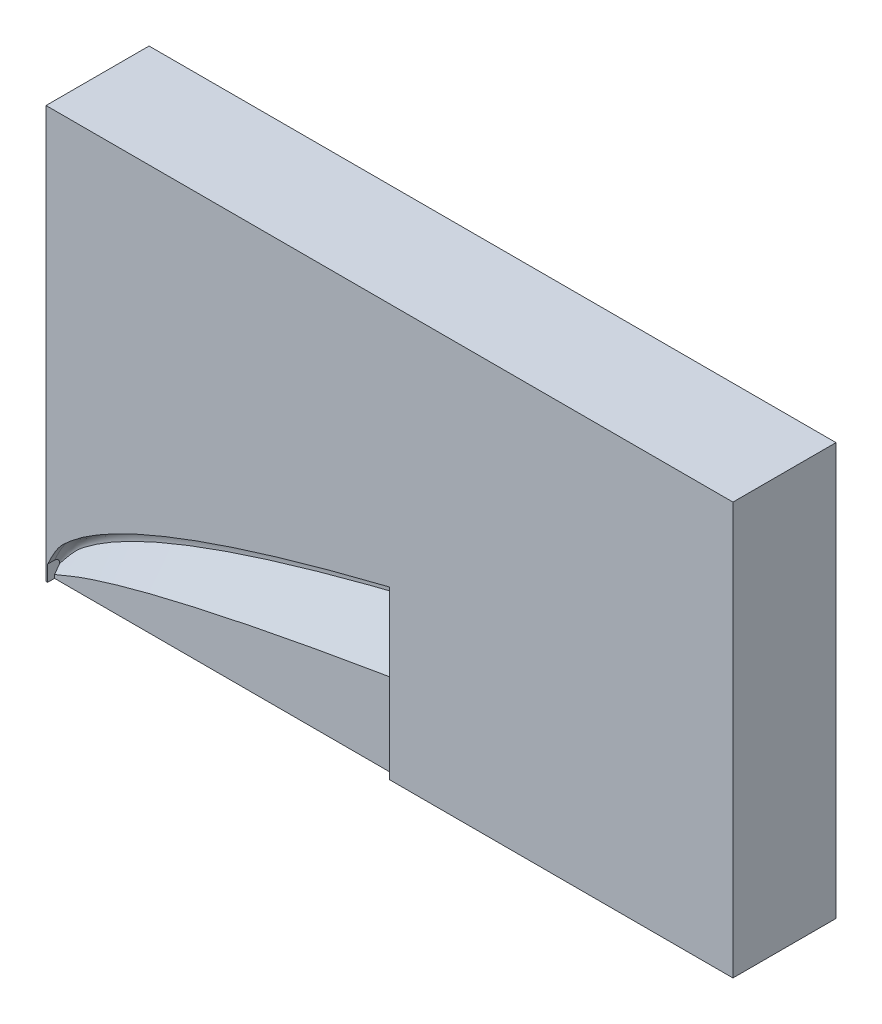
ISO-10303-21;
HEADER;
FILE_DESCRIPTION(('STEP AP214'),'2;1');
FILE_NAME('part.step','',(''),(''),'','','');
FILE_SCHEMA(('AUTOMOTIVE_DESIGN { 1 0 10303 214 1 1 1 1 }'));
ENDSEC;
DATA;
#1=APPLICATION_CONTEXT('core data for automotive mechanical design processes');
#2=APPLICATION_PROTOCOL_DEFINITION('international standard','automotive_design',2000,#1);
#3=PRODUCT_CONTEXT('',#1,'mechanical');
#4=PRODUCT('Part','Part','',(#3));
#5=PRODUCT_RELATED_PRODUCT_CATEGORY('part','',(#4));
#6=PRODUCT_DEFINITION_FORMATION('','',#4);
#7=PRODUCT_DEFINITION_CONTEXT('part definition',#1,'design');
#8=PRODUCT_DEFINITION('design','',#6,#7);
#9=PRODUCT_DEFINITION_SHAPE('','',#8);
#10=(LENGTH_UNIT() NAMED_UNIT(*) SI_UNIT(.MILLI.,.METRE.));
#11=(NAMED_UNIT(*) PLANE_ANGLE_UNIT() SI_UNIT($,.RADIAN.));
#12=(NAMED_UNIT(*) SI_UNIT($,.STERADIAN.) SOLID_ANGLE_UNIT());
#13=UNCERTAINTY_MEASURE_WITH_UNIT(LENGTH_MEASURE(1.E-05),#10,'distance_accuracy_value','');
#14=(GEOMETRIC_REPRESENTATION_CONTEXT(3) GLOBAL_UNCERTAINTY_ASSIGNED_CONTEXT((#13)) GLOBAL_UNIT_ASSIGNED_CONTEXT((#10,
#11,#12)) REPRESENTATION_CONTEXT('',''));
#15=CARTESIAN_POINT('',(0.,0.,0.));
#16=DIRECTION('',(0.,0.,1.));
#17=DIRECTION('',(1.,0.,0.));
#18=AXIS2_PLACEMENT_3D('',#15,#16,#17);
#19=CARTESIAN_POINT('',(0.,0.,-30.));
#20=DIRECTION('',(-1.,0.,0.));
#21=DIRECTION('',(0.,0.,1.));
#22=AXIS2_PLACEMENT_3D('',#19,#20,#21);
#23=PLANE('',#22);
#24=DIRECTION('',(0.,-1.,0.));
#25=VECTOR('',#24,1.);
#26=CARTESIAN_POINT('',(0.,0.,0.));
#27=LINE('',#26,#25);
#28=CARTESIAN_POINT('',(0.,120.,0.));
#29=VERTEX_POINT('',#28);
#30=CARTESIAN_POINT('',(0.,0.,0.));
#31=VERTEX_POINT('',#30);
#32=EDGE_CURVE('E478',#29,#31,#27,.T.);
#33=ORIENTED_EDGE('',*,*,#32,.F.);
#34=DIRECTION('',(0.,0.,1.));
#35=VECTOR('',#34,1.);
#36=CARTESIAN_POINT('',(0.,120.,-30.));
#37=LINE('',#36,#35);
#38=CARTESIAN_POINT('',(0.,120.,-30.));
#39=VERTEX_POINT('',#38);
#40=EDGE_CURVE('E161',#39,#29,#37,.T.);
#41=ORIENTED_EDGE('',*,*,#40,.F.);
#42=DIRECTION('',(0.,-1.,0.));
#43=VECTOR('',#42,1.);
#44=CARTESIAN_POINT('',(0.,0.,-30.));
#45=LINE('',#44,#43);
#46=CARTESIAN_POINT('',(0.,0.,-30.));
#47=VERTEX_POINT('',#46);
#48=EDGE_CURVE('E512',#39,#47,#45,.T.);
#49=ORIENTED_EDGE('',*,*,#48,.T.);
#50=DIRECTION('',(0.,0.,1.));
#51=VECTOR('',#50,1.);
#52=CARTESIAN_POINT('',(0.,0.,-30.));
#53=LINE('',#52,#51);
#54=EDGE_CURVE('E495',#47,#31,#53,.T.);
#55=ORIENTED_EDGE('',*,*,#54,.T.);
#56=EDGE_LOOP('',(#33,#41,#49,#55));
#57=FACE_BOUND('',#56,.T.);
#58=ADVANCED_FACE('F152',(#57),#23,.T.);
#59=CARTESIAN_POINT('',(0.,120.,-30.));
#60=DIRECTION('',(0.,1.,0.));
#61=DIRECTION('',(0.,0.,1.));
#62=AXIS2_PLACEMENT_3D('',#59,#60,#61);
#63=PLANE('',#62);
#64=DIRECTION('',(-1.,0.,0.));
#65=VECTOR('',#64,1.);
#66=CARTESIAN_POINT('',(0.,120.,0.));
#67=LINE('',#66,#65);
#68=CARTESIAN_POINT('',(200.,120.,0.));
#69=VERTEX_POINT('',#68);
#70=EDGE_CURVE('E513',#69,#29,#67,.T.);
#71=ORIENTED_EDGE('',*,*,#70,.F.);
#72=DIRECTION('',(0.,0.,1.));
#73=VECTOR('',#72,1.);
#74=CARTESIAN_POINT('',(200.,120.,-30.));
#75=LINE('',#74,#73);
#76=CARTESIAN_POINT('',(200.,120.,-30.));
#77=VERTEX_POINT('',#76);
#78=EDGE_CURVE('E501',#77,#69,#75,.T.);
#79=ORIENTED_EDGE('',*,*,#78,.F.);
#80=DIRECTION('',(-1.,0.,0.));
#81=VECTOR('',#80,1.);
#82=CARTESIAN_POINT('',(0.,120.,-30.));
#83=LINE('',#82,#81);
#84=EDGE_CURVE('E498',#77,#39,#83,.T.);
#85=ORIENTED_EDGE('',*,*,#84,.T.);
#86=ORIENTED_EDGE('',*,*,#40,.T.);
#87=EDGE_LOOP('',(#71,#79,#85,#86));
#88=FACE_BOUND('',#87,.T.);
#89=ADVANCED_FACE('F521',(#88),#63,.T.);
#90=CARTESIAN_POINT('',(200.,0.,-30.));
#91=DIRECTION('',(1.,0.,0.));
#92=DIRECTION('',(0.,0.,-1.));
#93=AXIS2_PLACEMENT_3D('',#90,#91,#92);
#94=PLANE('',#93);
#95=DIRECTION('',(0.,1.,0.));
#96=VECTOR('',#95,1.);
#97=CARTESIAN_POINT('',(200.,0.,0.));
#98=LINE('',#97,#96);
#99=CARTESIAN_POINT('',(200.,0.,0.));
#100=VERTEX_POINT('',#99);
#101=EDGE_CURVE('E487',#100,#69,#98,.T.);
#102=ORIENTED_EDGE('',*,*,#101,.F.);
#103=DIRECTION('',(0.,0.,1.));
#104=VECTOR('',#103,1.);
#105=CARTESIAN_POINT('',(200.,0.,-30.));
#106=LINE('',#105,#104);
#107=CARTESIAN_POINT('',(200.,0.,-30.));
#108=VERTEX_POINT('',#107);
#109=EDGE_CURVE('E497',#108,#100,#106,.T.);
#110=ORIENTED_EDGE('',*,*,#109,.F.);
#111=DIRECTION('',(0.,1.,0.));
#112=VECTOR('',#111,1.);
#113=CARTESIAN_POINT('',(200.,0.,-30.));
#114=LINE('',#113,#112);
#115=EDGE_CURVE('E506',#108,#77,#114,.T.);
#116=ORIENTED_EDGE('',*,*,#115,.T.);
#117=ORIENTED_EDGE('',*,*,#78,.T.);
#118=EDGE_LOOP('',(#102,#110,#116,#117));
#119=FACE_BOUND('',#118,.T.);
#120=ADVANCED_FACE('F529',(#119),#94,.T.);
#121=CARTESIAN_POINT('',(0.,0.,-30.));
#122=DIRECTION('',(0.,-1.,0.));
#123=DIRECTION('',(0.,0.,-1.));
#124=AXIS2_PLACEMENT_3D('',#121,#122,#123);
#125=PLANE('',#124);
#126=DIRECTION('',(0.,0.,-1.));
#127=VECTOR('',#126,1.);
#128=CARTESIAN_POINT('',(0.481457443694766,0.,-30.));
#129=LINE('',#128,#127);
#130=CARTESIAN_POINT('',(0.481457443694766,0.,0.));
#131=VERTEX_POINT('',#130);
#132=CARTESIAN_POINT('',(0.481457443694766,0.,-2.));
#133=VERTEX_POINT('',#132);
#134=EDGE_CURVE('E245',#131,#133,#129,.T.);
#135=ORIENTED_EDGE('',*,*,#134,.F.);
#136=DIRECTION('',(1.,0.,0.));
#137=VECTOR('',#136,1.);
#138=CARTESIAN_POINT('',(0.,0.,0.));
#139=LINE('',#138,#137);
#140=EDGE_CURVE('E492',#31,#131,#139,.T.);
#141=ORIENTED_EDGE('',*,*,#140,.F.);
#142=ORIENTED_EDGE('',*,*,#54,.F.);
#143=DIRECTION('',(1.,0.,0.));
#144=VECTOR('',#143,1.);
#145=CARTESIAN_POINT('',(0.,0.,-30.));
#146=LINE('',#145,#144);
#147=EDGE_CURVE('E509',#47,#108,#146,.T.);
#148=ORIENTED_EDGE('',*,*,#147,.T.);
#149=ORIENTED_EDGE('',*,*,#109,.T.);
#150=CARTESIAN_POINT('',(99.9988763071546,0.,0.));
#151=VERTEX_POINT('',#150);
#152=EDGE_CURVE('E480',#151,#100,#139,.T.);
#153=ORIENTED_EDGE('',*,*,#152,.F.);
#154=DIRECTION('',(0.,0.,-1.));
#155=VECTOR('',#154,1.);
#156=CARTESIAN_POINT('',(99.9988763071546,0.,-2.));
#157=LINE('',#156,#155);
#158=CARTESIAN_POINT('',(99.9988763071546,0.,-2.));
#159=VERTEX_POINT('',#158);
#160=EDGE_CURVE('E377',#151,#159,#157,.T.);
#161=ORIENTED_EDGE('',*,*,#160,.T.);
#162=DIRECTION('',(1.,0.,0.));
#163=VECTOR('',#162,1.);
#164=CARTESIAN_POINT('',(0.,0.,-2.));
#165=LINE('',#164,#163);
#166=EDGE_CURVE('E13',#133,#159,#165,.T.);
#167=ORIENTED_EDGE('',*,*,#166,.F.);
#168=EDGE_LOOP('',(#135,#141,#142,#148,#149,#153,#161,#167));
#169=FACE_BOUND('',#168,.T.);
#170=ADVANCED_FACE('F524',(#169),#125,.T.);
#171=CARTESIAN_POINT('',(0.,120.,-30.));
#172=DIRECTION('',(0.,0.,-1.));
#173=DIRECTION('',(-1.,0.,0.));
#174=AXIS2_PLACEMENT_3D('',#171,#172,#173);
#175=PLANE('',#174);
#176=ORIENTED_EDGE('',*,*,#48,.F.);
#177=ORIENTED_EDGE('',*,*,#84,.F.);
#178=ORIENTED_EDGE('',*,*,#115,.F.);
#179=ORIENTED_EDGE('',*,*,#147,.F.);
#180=EDGE_LOOP('',(#176,#177,#178,#179));
#181=FACE_BOUND('',#180,.T.);
#182=ADVANCED_FACE('F528',(#181),#175,.T.);
#183=CARTESIAN_POINT('',(0.,120.,0.));
#184=DIRECTION('',(0.,0.,-1.));
#185=DIRECTION('',(-1.,0.,0.));
#186=AXIS2_PLACEMENT_3D('',#183,#184,#185);
#187=PLANE('',#186);
#188=ORIENTED_EDGE('',*,*,#140,.T.);
#189=DIRECTION('',(0.,-1.,0.));
#190=VECTOR('',#189,1.);
#191=CARTESIAN_POINT('',(0.481457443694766,-43.9894252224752,0.));
#192=LINE('',#191,#190);
#193=CARTESIAN_POINT('',(0.481457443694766,4.6089647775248,0.));
#194=VERTEX_POINT('',#193);
#195=EDGE_CURVE('E370',#194,#131,#192,.T.);
#196=ORIENTED_EDGE('',*,*,#195,.F.);
#197=CARTESIAN_POINT('',(99.9988763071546,48.5981109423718,0.));
#198=CARTESIAN_POINT('',(95.3587288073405,47.4265567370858,0.));
#199=CARTESIAN_POINT('',(86.0819043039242,45.0843245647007,0.));
#200=CARTESIAN_POINT('',(72.2406828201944,41.2646789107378,0.));
#201=CARTESIAN_POINT('',(58.4882528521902,37.1449050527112,0.));
#202=CARTESIAN_POINT('',(46.3773778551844,33.1104216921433,0.));
#203=CARTESIAN_POINT('',(35.9137196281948,29.2026559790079,0.));
#204=CARTESIAN_POINT('',(27.088018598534,25.5123912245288,0.));
#205=CARTESIAN_POINT('',(20.2569325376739,22.2094537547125,0.));
#206=CARTESIAN_POINT('',(15.3743379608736,19.4776507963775,0.));
#207=CARTESIAN_POINT('',(12.3199721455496,17.5967241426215,0.));
#208=CARTESIAN_POINT('',(9.36198980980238,15.5669948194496,0.));
#209=CARTESIAN_POINT('',(6.58063969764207,13.3143572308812,0.));
#210=CARTESIAN_POINT('',(3.14156192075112,10.1823978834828,0.));
#211=CARTESIAN_POINT('',(1.53070770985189,6.80734691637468,0.));
#212=CARTESIAN_POINT('',(0.481457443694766,4.6089647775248,0.));
#213=B_SPLINE_CURVE_WITH_KNOTS('',3,(#197,#198,#199,#200,#201,#202,#203,#204,#205,#206,#207,
#208,#209,#210,#211,#212),.UNSPECIFIED.,.F.,.F.,(4,1,1,1,1,1,1,1,1,1,1,1,1,4),(0.,
0.13105213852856,0.262006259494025,0.392821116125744,0.523424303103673,0.61031352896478,
0.696968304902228,0.783225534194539,0.815412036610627,0.847459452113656,0.879309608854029,
0.910863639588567,0.941939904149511,1.),.UNSPECIFIED.);
#214=CARTESIAN_POINT('',(99.9988763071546,48.5981109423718,0.));
#215=VERTEX_POINT('',#214);
#216=EDGE_CURVE('E385',#194,#215,#213,.F.);
#217=ORIENTED_EDGE('',*,*,#216,.T.);
#218=DIRECTION('',(0.,-1.,0.));
#219=VECTOR('',#218,1.);
#220=CARTESIAN_POINT('',(99.9988763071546,0.,0.));
#221=LINE('',#220,#219);
#222=EDGE_CURVE('E169',#215,#151,#221,.T.);
#223=ORIENTED_EDGE('',*,*,#222,.T.);
#224=ORIENTED_EDGE('',*,*,#152,.T.);
#225=ORIENTED_EDGE('',*,*,#101,.T.);
#226=ORIENTED_EDGE('',*,*,#70,.T.);
#227=ORIENTED_EDGE('',*,*,#32,.T.);
#228=EDGE_LOOP('',(#188,#196,#217,#223,#224,#225,#226,#227));
#229=FACE_BOUND('',#228,.T.);
#230=ADVANCED_FACE('F336',(#229),#187,.F.);
#231=CARTESIAN_POINT('',(0.481457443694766,3.11207572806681,-2.));
#232=DIRECTION('',(-1.,0.,0.));
#233=DIRECTION('',(0.,0.,1.));
#234=AXIS2_PLACEMENT_3D('',#231,#232,#233);
#235=PLANE('',#234);
#236=ORIENTED_EDGE('',*,*,#134,.T.);
#237=DIRECTION('',(0.,1.,0.));
#238=VECTOR('',#237,1.);
#239=CARTESIAN_POINT('',(0.481457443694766,-43.9894252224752,-2.));
#240=LINE('',#239,#238);
#241=CARTESIAN_POINT('',(0.481457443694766,0.977488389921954,-2.));
#242=VERTEX_POINT('',#241);
#243=EDGE_CURVE('E236',#133,#242,#240,.T.);
#244=ORIENTED_EDGE('',*,*,#243,.T.);
#245=DIRECTION('',(0.,0.804956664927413,-0.593333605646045));
#246=VECTOR('',#245,1.);
#247=CARTESIAN_POINT('',(0.481457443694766,0.977488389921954,-2.));
#248=LINE('',#247,#246);
#249=CARTESIAN_POINT('',(0.481457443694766,3.00285685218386,-3.49289921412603));
#250=VERTEX_POINT('',#249);
#251=EDGE_CURVE('E241',#242,#250,#248,.T.);
#252=ORIENTED_EDGE('',*,*,#251,.T.);
#253=CARTESIAN_POINT('',(0.481457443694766,3.11207572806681,-2.));
#254=DIRECTION('',(1.,0.,0.));
#255=DIRECTION('',(0.,0.,1.));
#256=AXIS2_PLACEMENT_3D('',#253,#254,#255);
#257=CIRCLE('',#256,1.49688904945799);
#258=CARTESIAN_POINT('',(0.481457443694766,4.6089647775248,-2.00000002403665));
#259=VERTEX_POINT('',#258);
#260=EDGE_CURVE('E265',#250,#259,#257,.T.);
#261=ORIENTED_EDGE('',*,*,#260,.T.);
#262=DIRECTION('',(0.,0.,1.));
#263=VECTOR('',#262,1.);
#264=CARTESIAN_POINT('',(0.481457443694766,4.6089647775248,0.));
#265=LINE('',#264,#263);
#266=CARTESIAN_POINT('',(0.481457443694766,4.6089647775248,-1.98));
#267=VERTEX_POINT('',#266);
#268=EDGE_CURVE('E356',#259,#267,#265,.T.);
#269=ORIENTED_EDGE('',*,*,#268,.T.);
#270=EDGE_CURVE('E363',#267,#194,#265,.T.);
#271=ORIENTED_EDGE('',*,*,#270,.T.);
#272=ORIENTED_EDGE('',*,*,#195,.T.);
#273=EDGE_LOOP('',(#236,#244,#252,#261,#269,#271,#272));
#274=FACE_BOUND('',#273,.T.);
#275=ADVANCED_FACE('F239',(#274),#235,.F.);
#276=CARTESIAN_POINT('',(99.9988763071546,38.5981484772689,-2.));
#277=DIRECTION('',(-1.,0.,0.));
#278=DIRECTION('',(0.,0.,1.));
#279=AXIS2_PLACEMENT_3D('',#276,#277,#278);
#280=PLANE('',#279);
#281=ORIENTED_EDGE('',*,*,#160,.F.);
#282=ORIENTED_EDGE('',*,*,#222,.F.);
#283=DIRECTION('',(0.,3.80896703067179E-10,1.));
#284=VECTOR('',#283,1.);
#285=CARTESIAN_POINT('',(99.9988763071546,48.5981109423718,0.));
#286=LINE('',#285,#284);
#287=CARTESIAN_POINT('',(99.9988763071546,48.5981109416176,-1.98));
#288=VERTEX_POINT('',#287);
#289=EDGE_CURVE('E371',#288,#215,#286,.T.);
#290=ORIENTED_EDGE('',*,*,#289,.F.);
#291=CARTESIAN_POINT('',(99.9988763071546,48.59811094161,-2.));
#292=VERTEX_POINT('',#291);
#293=EDGE_CURVE('E405',#292,#288,#286,.T.);
#294=ORIENTED_EDGE('',*,*,#293,.F.);
#295=CARTESIAN_POINT('',(99.9988763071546,38.5981484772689,-2.));
#296=DIRECTION('',(1.,0.,0.));
#297=DIRECTION('',(0.,0.,1.));
#298=AXIS2_PLACEMENT_3D('',#295,#296,#297);
#299=CIRCLE('',#298,9.99996246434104);
#300=CARTESIAN_POINT('',(99.9988763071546,38.5981484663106,-11.999962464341));
#301=VERTEX_POINT('',#300);
#302=EDGE_CURVE('E422',#301,#292,#299,.T.);
#303=ORIENTED_EDGE('',*,*,#302,.F.);
#304=DIRECTION('',(0.,0.819152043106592,-0.573576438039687));
#305=VECTOR('',#304,1.);
#306=CARTESIAN_POINT('',(99.9988763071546,24.3167220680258,-2.));
#307=LINE('',#306,#305);
#308=CARTESIAN_POINT('',(99.9988763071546,24.3167220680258,-2.));
#309=VERTEX_POINT('',#308);
#310=EDGE_CURVE('E475',#309,#301,#307,.T.);
#311=ORIENTED_EDGE('',*,*,#310,.F.);
#312=DIRECTION('',(0.,1.,0.));
#313=VECTOR('',#312,1.);
#314=CARTESIAN_POINT('',(99.9988763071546,0.,-2.));
#315=LINE('',#314,#313);
#316=EDGE_CURVE('E155',#159,#309,#315,.T.);
#317=ORIENTED_EDGE('',*,*,#316,.F.);
#318=EDGE_LOOP('',(#281,#282,#290,#294,#303,#311,#317));
#319=FACE_BOUND('',#318,.T.);
#320=ADVANCED_FACE('F335',(#319),#280,.T.);
#321=CARTESIAN_POINT('',(99.9988763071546,48.5981109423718,0.));
#322=CARTESIAN_POINT('',(95.3587288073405,47.4265567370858,0.));
#323=CARTESIAN_POINT('',(86.0819043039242,45.0843245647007,0.));
#324=CARTESIAN_POINT('',(72.2406828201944,41.2646789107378,0.));
#325=CARTESIAN_POINT('',(58.4882528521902,37.1449050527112,0.));
#326=CARTESIAN_POINT('',(46.3773778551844,33.1104216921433,0.));
#327=CARTESIAN_POINT('',(35.9137196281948,29.2026559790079,0.));
#328=CARTESIAN_POINT('',(27.088018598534,25.5123912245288,0.));
#329=CARTESIAN_POINT('',(20.2569325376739,22.2094537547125,0.));
#330=CARTESIAN_POINT('',(15.3743379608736,19.4776507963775,0.));
#331=CARTESIAN_POINT('',(12.3199721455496,17.5967241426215,0.));
#332=CARTESIAN_POINT('',(9.36198980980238,15.5669948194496,0.));
#333=CARTESIAN_POINT('',(6.58063969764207,13.3143572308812,0.));
#334=CARTESIAN_POINT('',(3.14156192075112,10.1823978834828,0.));
#335=CARTESIAN_POINT('',(1.53070770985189,6.80734691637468,0.));
#336=CARTESIAN_POINT('',(0.481457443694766,4.6089647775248,0.));
#337=CARTESIAN_POINT('',(99.9988763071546,48.5981109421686,-0.533333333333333));
#338=CARTESIAN_POINT('',(95.3587288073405,47.4265567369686,-0.533333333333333));
#339=CARTESIAN_POINT('',(86.0819043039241,45.0843245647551,-0.533333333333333));
#340=CARTESIAN_POINT('',(72.2406828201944,41.2646789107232,-0.533333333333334));
#341=CARTESIAN_POINT('',(58.4882528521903,37.1449050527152,-0.533333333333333));
#342=CARTESIAN_POINT('',(46.3773778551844,33.1104216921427,-0.533333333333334));
#343=CARTESIAN_POINT('',(35.9137196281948,29.202655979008,-0.533333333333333));
#344=CARTESIAN_POINT('',(27.088018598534,25.5123912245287,-0.533333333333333));
#345=CARTESIAN_POINT('',(20.2569325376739,22.2094537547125,-0.533333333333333));
#346=CARTESIAN_POINT('',(15.3743379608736,19.4776507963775,-0.533333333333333));
#347=CARTESIAN_POINT('',(12.3199721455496,17.5967241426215,-0.533333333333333));
#348=CARTESIAN_POINT('',(9.36198980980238,15.5669948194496,-0.533333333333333));
#349=CARTESIAN_POINT('',(6.58063969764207,13.3143572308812,-0.533333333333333));
#350=CARTESIAN_POINT('',(3.14156192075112,10.1823978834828,-0.533333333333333));
#351=CARTESIAN_POINT('',(1.53070770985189,6.80734691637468,-0.533333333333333));
#352=CARTESIAN_POINT('',(0.481457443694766,4.6089647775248,-0.533333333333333));
#353=CARTESIAN_POINT('',(99.9988763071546,48.5981109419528,-1.1));
#354=CARTESIAN_POINT('',(95.3587288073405,47.426556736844,-1.1));
#355=CARTESIAN_POINT('',(86.0819043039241,45.0843245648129,-1.1));
#356=CARTESIAN_POINT('',(72.2406828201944,41.2646789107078,-1.1));
#357=CARTESIAN_POINT('',(58.4882528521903,37.1449050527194,-1.1));
#358=CARTESIAN_POINT('',(46.3773778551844,33.1104216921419,-1.1));
#359=CARTESIAN_POINT('',(35.9137196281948,29.2026559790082,-1.1));
#360=CARTESIAN_POINT('',(27.088018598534,25.5123912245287,-1.1));
#361=CARTESIAN_POINT('',(20.2569325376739,22.2094537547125,-1.1));
#362=CARTESIAN_POINT('',(15.3743379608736,19.4776507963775,-1.1));
#363=CARTESIAN_POINT('',(12.3199721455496,17.5967241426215,-1.1));
#364=CARTESIAN_POINT('',(9.36198980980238,15.5669948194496,-1.1));
#365=CARTESIAN_POINT('',(6.58063969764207,13.3143572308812,-1.1));
#366=CARTESIAN_POINT('',(3.14156192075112,10.1823978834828,-1.1));
#367=CARTESIAN_POINT('',(1.53070770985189,6.80734691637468,-1.1));
#368=CARTESIAN_POINT('',(0.481457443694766,4.6089647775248,-1.1));
#369=CARTESIAN_POINT('',(99.9988763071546,48.5981109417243,-1.7));
#370=CARTESIAN_POINT('',(95.3587288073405,47.426556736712,-1.7));
#371=CARTESIAN_POINT('',(86.0819043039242,45.0843245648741,-1.7));
#372=CARTESIAN_POINT('',(72.2406828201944,41.2646789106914,-1.7));
#373=CARTESIAN_POINT('',(58.4882528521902,37.1449050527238,-1.7));
#374=CARTESIAN_POINT('',(46.3773778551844,33.1104216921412,-1.7));
#375=CARTESIAN_POINT('',(35.9137196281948,29.2026559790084,-1.7));
#376=CARTESIAN_POINT('',(27.088018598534,25.5123912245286,-1.7));
#377=CARTESIAN_POINT('',(20.2569325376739,22.2094537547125,-1.7));
#378=CARTESIAN_POINT('',(15.3743379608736,19.4776507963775,-1.7));
#379=CARTESIAN_POINT('',(12.3199721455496,17.5967241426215,-1.7));
#380=CARTESIAN_POINT('',(9.36198980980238,15.5669948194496,-1.7));
#381=CARTESIAN_POINT('',(6.58063969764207,13.3143572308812,-1.7));
#382=CARTESIAN_POINT('',(3.14156192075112,10.1823978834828,-1.7));
#383=CARTESIAN_POINT('',(1.53070770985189,6.80734691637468,-1.7));
#384=CARTESIAN_POINT('',(0.481457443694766,4.6089647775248,-1.7));
#385=CARTESIAN_POINT('',(99.9988763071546,48.5981109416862,-1.8));
#386=CARTESIAN_POINT('',(95.3587288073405,47.42655673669,-1.8));
#387=CARTESIAN_POINT('',(86.0819043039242,45.0843245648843,-1.8));
#388=CARTESIAN_POINT('',(72.2406828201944,41.2646789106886,-1.8));
#389=CARTESIAN_POINT('',(58.4882528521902,37.1449050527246,-1.8));
#390=CARTESIAN_POINT('',(46.3773778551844,33.1104216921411,-1.8));
#391=CARTESIAN_POINT('',(35.9137196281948,29.2026559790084,-1.8));
#392=CARTESIAN_POINT('',(27.088018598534,25.5123912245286,-1.8));
#393=CARTESIAN_POINT('',(20.2569325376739,22.2094537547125,-1.80000000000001));
#394=CARTESIAN_POINT('',(15.3743379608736,19.4776507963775,-1.8));
#395=CARTESIAN_POINT('',(12.3199721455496,17.5967241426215,-1.8));
#396=CARTESIAN_POINT('',(9.36198980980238,15.5669948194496,-1.8));
#397=CARTESIAN_POINT('',(6.58063969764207,13.3143572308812,-1.8));
#398=CARTESIAN_POINT('',(3.14156192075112,10.1823978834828,-1.8));
#399=CARTESIAN_POINT('',(1.53070770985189,6.80734691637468,-1.8));
#400=CARTESIAN_POINT('',(0.481457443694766,4.6089647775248,-1.8));
#401=CARTESIAN_POINT('',(99.9988763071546,48.5981109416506,-1.89333333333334));
#402=CARTESIAN_POINT('',(95.3587288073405,47.4265567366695,-1.89333333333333));
#403=CARTESIAN_POINT('',(86.0819043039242,45.0843245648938,-1.89333333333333));
#404=CARTESIAN_POINT('',(72.2406828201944,41.2646789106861,-1.89333333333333));
#405=CARTESIAN_POINT('',(58.4882528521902,37.1449050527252,-1.89333333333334));
#406=CARTESIAN_POINT('',(46.3773778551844,33.1104216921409,-1.89333333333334));
#407=CARTESIAN_POINT('',(35.9137196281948,29.2026559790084,-1.89333333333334));
#408=CARTESIAN_POINT('',(27.088018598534,25.5123912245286,-1.89333333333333));
#409=CARTESIAN_POINT('',(20.2569325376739,22.2094537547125,-1.89333333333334));
#410=CARTESIAN_POINT('',(15.3743379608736,19.4776507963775,-1.89333333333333));
#411=CARTESIAN_POINT('',(12.3199721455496,17.5967241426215,-1.89333333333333));
#412=CARTESIAN_POINT('',(9.36198980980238,15.5669948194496,-1.89333333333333));
#413=CARTESIAN_POINT('',(6.58063969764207,13.3143572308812,-1.89333333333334));
#414=CARTESIAN_POINT('',(3.14156192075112,10.1823978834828,-1.89333333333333));
#415=CARTESIAN_POINT('',(1.53070770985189,6.80734691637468,-1.89333333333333));
#416=CARTESIAN_POINT('',(0.481457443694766,4.6089647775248,-1.89333333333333));
#417=CARTESIAN_POINT('',(99.9988763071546,48.5981109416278,-1.95333333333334));
#418=CARTESIAN_POINT('',(95.3587288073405,47.4265567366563,-1.95333333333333));
#419=CARTESIAN_POINT('',(86.0819043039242,45.0843245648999,-1.95333333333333));
#420=CARTESIAN_POINT('',(72.2406828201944,41.2646789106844,-1.95333333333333));
#421=CARTESIAN_POINT('',(58.4882528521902,37.1449050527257,-1.95333333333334));
#422=CARTESIAN_POINT('',(46.3773778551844,33.1104216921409,-1.95333333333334));
#423=CARTESIAN_POINT('',(35.9137196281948,29.2026559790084,-1.95333333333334));
#424=CARTESIAN_POINT('',(27.088018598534,25.5123912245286,-1.95333333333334));
#425=CARTESIAN_POINT('',(20.2569325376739,22.2094537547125,-1.95333333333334));
#426=CARTESIAN_POINT('',(15.3743379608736,19.4776507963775,-1.95333333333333));
#427=CARTESIAN_POINT('',(12.3199721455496,17.5967241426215,-1.95333333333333));
#428=CARTESIAN_POINT('',(9.36198980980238,15.5669948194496,-1.95333333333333));
#429=CARTESIAN_POINT('',(6.58063969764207,13.3143572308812,-1.95333333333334));
#430=CARTESIAN_POINT('',(3.14156192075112,10.1823978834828,-1.95333333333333));
#431=CARTESIAN_POINT('',(1.53070770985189,6.80734691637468,-1.95333333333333));
#432=CARTESIAN_POINT('',(0.481457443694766,4.6089647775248,-1.95333333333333));
#433=CARTESIAN_POINT('',(99.9988763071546,48.5981109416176,-1.98));
#434=CARTESIAN_POINT('',(95.3587288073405,47.4265567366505,-1.98));
#435=CARTESIAN_POINT('',(86.0819043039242,45.0843245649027,-1.98));
#436=CARTESIAN_POINT('',(72.2406828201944,41.2646789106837,-1.98));
#437=CARTESIAN_POINT('',(58.4882528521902,37.1449050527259,-1.98));
#438=CARTESIAN_POINT('',(46.3773778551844,33.1104216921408,-1.98));
#439=CARTESIAN_POINT('',(35.9137196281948,29.2026559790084,-1.98));
#440=CARTESIAN_POINT('',(27.088018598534,25.5123912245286,-1.98));
#441=CARTESIAN_POINT('',(20.2569325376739,22.2094537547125,-1.98000000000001));
#442=CARTESIAN_POINT('',(15.3743379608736,19.4776507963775,-1.98));
#443=CARTESIAN_POINT('',(12.3199721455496,17.5967241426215,-1.98));
#444=CARTESIAN_POINT('',(9.36198980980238,15.5669948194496,-1.98));
#445=CARTESIAN_POINT('',(6.58063969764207,13.3143572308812,-1.98));
#446=CARTESIAN_POINT('',(3.14156192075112,10.1823978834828,-1.98));
#447=CARTESIAN_POINT('',(1.53070770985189,6.80734691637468,-1.98));
#448=CARTESIAN_POINT('',(0.481457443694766,4.6089647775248,-1.98));
#449=B_SPLINE_SURFACE_WITH_KNOTS('',3,3,((#321,#322,#323,#324,#325,#326,#327,#328,#329,#330,
#331,#332,#333,#334,#335,#336),(#337,#338,#339,#340,#341,#342,#343,#344,#345,#346,#347,#348,
#349,#350,#351,#352),(#353,#354,#355,#356,#357,#358,#359,#360,#361,#362,#363,#364,#365,#366,
#367,#368),(#369,#370,#371,#372,#373,#374,#375,#376,#377,#378,#379,#380,#381,#382,#383,#384),
(#385,#386,#387,#388,#389,#390,#391,#392,#393,#394,#395,#396,#397,#398,#399,#400),(#401,#402,
#403,#404,#405,#406,#407,#408,#409,#410,#411,#412,#413,#414,#415,#416),(#417,#418,#419,#420,
#421,#422,#423,#424,#425,#426,#427,#428,#429,#430,#431,#432),(#433,#434,#435,#436,#437,#438,
#439,#440,#441,#442,#443,#444,#445,#446,#447,#448)),.UNSPECIFIED.,.F.,.F.,.F.,(4,1,1,1,1,4),(4,
1,1,1,1,1,1,1,1,1,1,1,1,4),(0.,0.808080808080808,0.858585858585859,0.909090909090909,
0.95959595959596,1.),(0.,0.13105213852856,0.262006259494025,0.392821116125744,0.523424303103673,
0.61031352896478,0.696968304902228,0.783225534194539,0.815412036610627,0.847459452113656,
0.879309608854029,0.910863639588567,0.941939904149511,1.),.UNSPECIFIED.);
#450=CARTESIAN_POINT('',(99.9988763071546,48.5981109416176,-1.98));
#451=CARTESIAN_POINT('',(95.3587288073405,47.4265567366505,-1.98));
#452=CARTESIAN_POINT('',(86.0819043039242,45.0843245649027,-1.98));
#453=CARTESIAN_POINT('',(72.2406828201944,41.2646789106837,-1.98));
#454=CARTESIAN_POINT('',(58.4882528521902,37.1449050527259,-1.98));
#455=CARTESIAN_POINT('',(46.3773778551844,33.1104216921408,-1.98));
#456=CARTESIAN_POINT('',(35.9137196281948,29.2026559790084,-1.98));
#457=CARTESIAN_POINT('',(27.088018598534,25.5123912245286,-1.98));
#458=CARTESIAN_POINT('',(20.2569325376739,22.2094537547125,-1.98000000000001));
#459=CARTESIAN_POINT('',(15.3743379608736,19.4776507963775,-1.98));
#460=CARTESIAN_POINT('',(12.3199721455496,17.5967241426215,-1.98));
#461=CARTESIAN_POINT('',(9.36198980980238,15.5669948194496,-1.98));
#462=CARTESIAN_POINT('',(6.58063969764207,13.3143572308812,-1.98));
#463=CARTESIAN_POINT('',(3.14156192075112,10.1823978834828,-1.98));
#464=CARTESIAN_POINT('',(1.53070770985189,6.80734691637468,-1.98));
#465=CARTESIAN_POINT('',(0.481457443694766,4.6089647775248,-1.98));
#466=B_SPLINE_CURVE_WITH_KNOTS('',3,(#450,#451,#452,#453,#454,#455,#456,#457,#458,#459,#460,
#461,#462,#463,#464,#465),.UNSPECIFIED.,.F.,.F.,(4,1,1,1,1,1,1,1,1,1,1,1,1,4),(0.,
0.13105213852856,0.262006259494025,0.392821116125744,0.523424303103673,0.61031352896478,
0.696968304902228,0.783225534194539,0.815412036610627,0.847459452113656,0.879309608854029,
0.910863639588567,0.941939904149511,1.),.UNSPECIFIED.);
#467=EDGE_CURVE('E379',#288,#267,#466,.T.);
#468=ORIENTED_EDGE('',*,*,#289,.T.);
#469=ORIENTED_EDGE('',*,*,#216,.F.);
#470=ORIENTED_EDGE('',*,*,#270,.F.);
#471=ORIENTED_EDGE('',*,*,#467,.F.);
#472=EDGE_LOOP('',(#468,#469,#470,#471));
#473=FACE_BOUND('',#472,.T.);
#474=ADVANCED_FACE('F429',(#473),#449,.F.);
#475=CARTESIAN_POINT('',(99.9988763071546,48.5981109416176,-1.98));
#476=CARTESIAN_POINT('',(95.3587288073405,47.4265567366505,-1.98));
#477=CARTESIAN_POINT('',(86.0819043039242,45.0843245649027,-1.98));
#478=CARTESIAN_POINT('',(72.2406828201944,41.2646789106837,-1.98));
#479=CARTESIAN_POINT('',(58.4882528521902,37.1449050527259,-1.98));
#480=CARTESIAN_POINT('',(46.3773778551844,33.1104216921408,-1.98));
#481=CARTESIAN_POINT('',(35.9137196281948,29.2026559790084,-1.98));
#482=CARTESIAN_POINT('',(27.088018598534,25.5123912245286,-1.98));
#483=CARTESIAN_POINT('',(20.2569325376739,22.2094537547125,-1.98000000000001));
#484=CARTESIAN_POINT('',(15.3743379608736,19.4776507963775,-1.98));
#485=CARTESIAN_POINT('',(12.3199721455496,17.5967241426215,-1.98));
#486=CARTESIAN_POINT('',(9.36198980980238,15.5669948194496,-1.98));
#487=CARTESIAN_POINT('',(6.58063969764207,13.3143572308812,-1.98));
#488=CARTESIAN_POINT('',(3.14156192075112,10.1823978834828,-1.98));
#489=CARTESIAN_POINT('',(1.53070770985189,6.80734691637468,-1.98));
#490=CARTESIAN_POINT('',(0.481457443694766,4.6089647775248,-1.98));
#491=CARTESIAN_POINT('',(99.9988763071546,48.5981109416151,-1.98666666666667));
#492=CARTESIAN_POINT('',(95.3587288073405,47.426556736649,-1.98666666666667));
#493=CARTESIAN_POINT('',(86.0819043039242,45.0843245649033,-1.98666666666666));
#494=CARTESIAN_POINT('',(72.2406828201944,41.2646789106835,-1.98666666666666));
#495=CARTESIAN_POINT('',(58.4882528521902,37.1449050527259,-1.98666666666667));
#496=CARTESIAN_POINT('',(46.3773778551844,33.1104216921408,-1.98666666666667));
#497=CARTESIAN_POINT('',(35.9137196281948,29.2026559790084,-1.98666666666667));
#498=CARTESIAN_POINT('',(27.088018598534,25.5123912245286,-1.98666666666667));
#499=CARTESIAN_POINT('',(20.2569325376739,22.2094537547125,-1.98666666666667));
#500=CARTESIAN_POINT('',(15.3743379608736,19.4776507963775,-1.98666666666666));
#501=CARTESIAN_POINT('',(12.3199721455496,17.5967241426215,-1.98666666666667));
#502=CARTESIAN_POINT('',(9.36198980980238,15.5669948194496,-1.98666666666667));
#503=CARTESIAN_POINT('',(6.58063969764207,13.3143572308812,-1.98666666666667));
#504=CARTESIAN_POINT('',(3.14156192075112,10.1823978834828,-1.98666666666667));
#505=CARTESIAN_POINT('',(1.53070770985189,6.80734691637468,-1.98666666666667));
#506=CARTESIAN_POINT('',(0.481457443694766,4.6089647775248,-1.98666666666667));
#507=CARTESIAN_POINT('',(99.9988763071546,48.5981109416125,-1.99333333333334));
#508=CARTESIAN_POINT('',(95.3587288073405,47.4265567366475,-1.99333333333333));
#509=CARTESIAN_POINT('',(86.0819043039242,45.084324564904,-1.99333333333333));
#510=CARTESIAN_POINT('',(72.2406828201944,41.2646789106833,-1.99333333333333));
#511=CARTESIAN_POINT('',(58.4882528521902,37.144905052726,-1.99333333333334));
#512=CARTESIAN_POINT('',(46.3773778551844,33.1104216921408,-1.99333333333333));
#513=CARTESIAN_POINT('',(35.9137196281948,29.2026559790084,-1.99333333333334));
#514=CARTESIAN_POINT('',(27.088018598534,25.5123912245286,-1.99333333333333));
#515=CARTESIAN_POINT('',(20.2569325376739,22.2094537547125,-1.99333333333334));
#516=CARTESIAN_POINT('',(15.3743379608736,19.4776507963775,-1.99333333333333));
#517=CARTESIAN_POINT('',(12.3199721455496,17.5967241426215,-1.99333333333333));
#518=CARTESIAN_POINT('',(9.36198980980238,15.5669948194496,-1.99333333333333));
#519=CARTESIAN_POINT('',(6.58063969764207,13.3143572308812,-1.99333333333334));
#520=CARTESIAN_POINT('',(3.14156192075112,10.1823978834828,-1.99333333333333));
#521=CARTESIAN_POINT('',(1.53070770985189,6.80734691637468,-1.99333333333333));
#522=CARTESIAN_POINT('',(0.481457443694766,4.6089647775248,-1.99333333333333));
#523=CARTESIAN_POINT('',(99.9988763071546,48.59811094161,-2.13260399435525));
#524=CARTESIAN_POINT('',(95.3587288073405,47.4265567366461,-2.13049941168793));
#525=CARTESIAN_POINT('',(86.0819043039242,45.0843245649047,-2.12629182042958));
#526=CARTESIAN_POINT('',(72.2406828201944,41.2646789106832,-2.11913794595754));
#527=CARTESIAN_POINT('',(58.4882528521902,37.144905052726,-2.11112105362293));
#528=CARTESIAN_POINT('',(46.3773778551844,33.1104216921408,-2.10288093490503));
#529=CARTESIAN_POINT('',(35.9137196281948,29.2026559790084,-2.09447176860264));
#530=CARTESIAN_POINT('',(27.088018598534,25.5123912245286,-2.08612168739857));
#531=CARTESIAN_POINT('',(20.2569325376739,22.2094537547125,-2.07816516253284));
#532=CARTESIAN_POINT('',(15.3743379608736,19.4776507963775,-2.07115263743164));
#533=CARTESIAN_POINT('',(12.3199721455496,17.5967241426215,-2.0661203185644));
#534=CARTESIAN_POINT('',(9.36198980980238,15.5669948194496,-2.06047103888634));
#535=CARTESIAN_POINT('',(6.58063969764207,13.3143572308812,-2.05369162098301));
#536=CARTESIAN_POINT('',(3.14156192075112,10.1823978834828,-2.04419571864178));
#537=CARTESIAN_POINT('',(1.53070770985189,6.80734691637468,-2.03002677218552));
#538=CARTESIAN_POINT('',(0.481457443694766,4.6089647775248,-2.02079764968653));
#539=CARTESIAN_POINT('',(99.9988763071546,48.5928428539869,-2.39726987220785));
#540=CARTESIAN_POINT('',(95.3587288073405,47.4213722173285,-2.39096471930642));
#541=CARTESIAN_POINT('',(86.0819043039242,45.0793071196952,-2.37835912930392));
#542=CARTESIAN_POINT('',(72.2406828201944,41.259945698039,-2.35692675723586));
#543=CARTESIAN_POINT('',(58.4882528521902,37.1404903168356,-2.33290885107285));
#544=CARTESIAN_POINT('',(46.3773778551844,33.1063343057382,-2.30822217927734));
#545=CARTESIAN_POINT('',(35.9137196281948,29.1989026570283,-2.28302905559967));
#546=CARTESIAN_POINT('',(27.088018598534,25.5089696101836,-2.25801294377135));
#547=CARTESIAN_POINT('',(20.2569325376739,22.2063482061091,-2.23417589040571));
#548=CARTESIAN_POINT('',(15.3743379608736,19.4748238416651,-2.2131669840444));
#549=CARTESIAN_POINT('',(12.3199721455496,17.5940969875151,-2.19809057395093));
#550=CARTESIAN_POINT('',(9.36198980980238,15.5645924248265,-2.18116590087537));
#551=CARTESIAN_POINT('',(6.58063969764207,13.3122228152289,-2.16085507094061));
#552=CARTESIAN_POINT('',(3.14156192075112,10.1806467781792,-2.13240749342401));
#553=CARTESIAN_POINT('',(1.53070770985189,6.80613206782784,-2.08995282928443));
#554=CARTESIAN_POINT('',(0.481457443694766,4.6080992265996,-2.06229944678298));
#555=CARTESIAN_POINT('',(99.9988763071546,48.5693104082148,-2.79222240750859));
#556=CARTESIAN_POINT('',(95.3587288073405,47.3982130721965,-2.77964884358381));
#557=CARTESIAN_POINT('',(86.0819043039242,45.0568942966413,-2.75451111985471));
#558=CARTESIAN_POINT('',(72.2406828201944,41.2388025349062,-2.71177141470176));
#559=CARTESIAN_POINT('',(58.4882528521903,37.1207697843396,-2.66387568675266));
#560=CARTESIAN_POINT('',(46.3773778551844,33.0880760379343,-2.61464633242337));
#561=CARTESIAN_POINT('',(35.9137196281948,29.1821366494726,-2.5644070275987));
#562=CARTESIAN_POINT('',(27.088018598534,25.4936853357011,-2.51452070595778));
#563=CARTESIAN_POINT('',(20.2569325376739,22.1924757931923,-2.46698561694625));
#564=CARTESIAN_POINT('',(15.3743379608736,19.4621959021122,-2.42509035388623));
#565=CARTESIAN_POINT('',(12.3199721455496,17.5823615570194,-2.39502536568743));
#566=CARTESIAN_POINT('',(9.36198980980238,15.5538609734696,-2.36127503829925));
#567=CARTESIAN_POINT('',(6.58063969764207,13.3026885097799,-2.32077063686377));
#568=CARTESIAN_POINT('',(3.14156192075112,10.1728243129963,-2.26404688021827));
#569=CARTESIAN_POINT('',(1.53070770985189,6.80070680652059,-2.17936120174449));
#570=CARTESIAN_POINT('',(0.481457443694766,4.6042354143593,-2.1242001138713));
#571=CARTESIAN_POINT('',(99.9988763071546,48.530321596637,-3.18470871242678));
#572=CARTESIAN_POINT('',(95.3587288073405,47.3598427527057,-3.16590584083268));
#573=CARTESIAN_POINT('',(86.0819043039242,45.019760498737,-3.12831416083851));
#574=CARTESIAN_POINT('',(72.2406828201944,41.2037723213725,-3.06440019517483));
#575=CARTESIAN_POINT('',(58.4882528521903,37.0880966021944,-2.99277573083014));
#576=CARTESIAN_POINT('',(46.3773778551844,33.0578255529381,-2.91915693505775));
#577=CARTESIAN_POINT('',(35.9137196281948,29.1543585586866,-2.84402783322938));
#578=CARTESIAN_POINT('',(27.088018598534,25.4683621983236,-2.7694265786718));
#579=CARTESIAN_POINT('',(20.2569325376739,22.1694918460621,-2.69834140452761));
#580=CARTESIAN_POINT('',(15.3743379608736,19.4412738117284,-2.63569020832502));
#581=CARTESIAN_POINT('',(12.3199721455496,17.5629181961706,-2.59073011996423));
#582=CARTESIAN_POINT('',(9.36198980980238,15.5360809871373,-2.54025951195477));
#583=CARTESIAN_POINT('',(6.58063969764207,13.2868920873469,-2.47968636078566));
#584=CARTESIAN_POINT('',(3.14156192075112,10.1598635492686,-2.39486870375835));
#585=CARTESIAN_POINT('',(1.53070770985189,6.79172011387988,-2.26819060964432));
#586=CARTESIAN_POINT('',(0.481457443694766,4.59783728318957,-2.18567723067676));
#587=CARTESIAN_POINT('',(99.9988763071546,48.2046942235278,-5.52230946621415));
#588=CARTESIAN_POINT('',(95.3587288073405,47.0393809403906,-5.46640532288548));
#589=CARTESIAN_POINT('',(86.0819043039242,44.7096259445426,-5.35463884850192));
#590=CARTESIAN_POINT('',(72.2406828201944,40.9112065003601,-5.1646137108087));
#591=CARTESIAN_POINT('',(58.4882528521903,36.815216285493,-4.95166365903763));
#592=CARTESIAN_POINT('',(46.3773778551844,32.8051791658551,-4.73278422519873));
#593=CARTESIAN_POINT('',(35.9137196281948,28.9223611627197,-4.50941442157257));
#594=CARTESIAN_POINT('',(27.088018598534,25.2568681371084,-4.28761387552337));
#595=CARTESIAN_POINT('',(20.2569325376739,21.9775342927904,-4.0762670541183));
#596=CARTESIAN_POINT('',(15.3743379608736,19.2665365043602,-3.88999605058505));
#597=CARTESIAN_POINT('',(12.3199721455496,17.400531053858,-3.75632174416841));
#598=CARTESIAN_POINT('',(9.36198980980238,15.3875858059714,-3.60626932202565));
#599=CARTESIAN_POINT('',(6.58063969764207,13.1549642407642,-3.42616025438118));
#600=CARTESIAN_POINT('',(3.14156192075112,10.051614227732,-3.17405853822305));
#601=CARTESIAN_POINT('',(1.53070770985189,6.71668071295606,-2.79710376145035));
#602=CARTESIAN_POINT('',(0.481457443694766,4.54442958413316,-2.55156949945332));
#603=CARTESIAN_POINT('',(99.9988763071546,47.1694326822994,-7.57079833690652));
#604=CARTESIAN_POINT('',(95.3587288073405,46.0205424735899,-7.48237906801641));
#605=CARTESIAN_POINT('',(86.0819043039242,43.7236213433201,-7.3056066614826));
#606=CARTESIAN_POINT('',(72.2406828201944,39.9810577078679,-7.00506903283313));
#607=CARTESIAN_POINT('',(58.4882528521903,35.9476534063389,-6.6682713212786));
#608=CARTESIAN_POINT('',(46.3773778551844,32.001945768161,-6.3220961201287));
#609=CARTESIAN_POINT('',(35.9137196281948,28.1847768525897,-5.96881899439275));
#610=CARTESIAN_POINT('',(27.088018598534,24.58446989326,-5.61802319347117));
#611=CARTESIAN_POINT('',(20.2569325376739,21.3672483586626,-5.28376028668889));
#612=CARTESIAN_POINT('',(15.3743379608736,18.7109985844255,-4.98915871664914));
#613=CARTESIAN_POINT('',(12.3199721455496,16.8842587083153,-4.77773483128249));
#614=CARTESIAN_POINT('',(9.36198980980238,14.9154775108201,-4.54043643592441));
#615=CARTESIAN_POINT('',(6.58063969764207,12.7355381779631,-4.2554940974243));
#616=CARTESIAN_POINT('',(3.14156192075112,9.70742404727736,-3.85716268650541));
#617=CARTESIAN_POINT('',(1.53070770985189,6.47827123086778,-3.25928117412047));
#618=CARTESIAN_POINT('',(0.481457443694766,4.37492169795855,-2.86984348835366));
#619=CARTESIAN_POINT('',(99.9988763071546,43.7938860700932,-10.9463449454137));
#620=CARTESIAN_POINT('',(95.3587288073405,42.6985488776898,-10.8043308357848));
#621=CARTESIAN_POINT('',(86.0819043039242,40.5086937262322,-10.520408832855));
#622=CARTESIAN_POINT('',(72.2406828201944,36.9482496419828,-10.0377749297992));
#623=CARTESIAN_POINT('',(58.4882528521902,33.1189131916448,-9.49689154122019));
#624=CARTESIAN_POINT('',(46.3773778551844,29.3829579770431,-8.94095042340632));
#625=CARTESIAN_POINT('',(35.9137196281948,25.7798442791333,-8.37360362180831));
#626=CARTESIAN_POINT('',(27.088018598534,22.3920837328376,-7.81023763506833));
#627=CARTESIAN_POINT('',(20.2569325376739,19.3773872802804,-7.27341930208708));
#628=CARTESIAN_POINT('',(15.3743379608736,16.899647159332,-6.80030854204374));
#629=CARTESIAN_POINT('',(12.3199721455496,15.2009489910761,-6.46072076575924));
#630=CARTESIAN_POINT('',(9.36198980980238,13.3761320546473,-6.07977877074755));
#631=CARTESIAN_POINT('',(6.58063969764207,11.3681148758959,-5.62158303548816));
#632=CARTESIAN_POINT('',(3.14156192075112,8.58464906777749,-4.98456065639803));
#633=CARTESIAN_POINT('',(1.53070770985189,5.70331744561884,-4.01265084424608));
#634=CARTESIAN_POINT('',(0.481457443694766,3.82652564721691,-3.37958509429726));
#635=CARTESIAN_POINT('',(99.9988763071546,41.2502283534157,-11.9999624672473));
#636=CARTESIAN_POINT('',(95.3587288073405,40.1952507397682,-11.8412031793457));
#637=CARTESIAN_POINT('',(86.0819043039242,38.0860845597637,-11.5238033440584));
#638=CARTESIAN_POINT('',(72.2406828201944,34.662874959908,-10.9843404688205));
#639=CARTESIAN_POINT('',(58.4882528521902,30.9873166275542,-10.3797482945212));
#640=CARTESIAN_POINT('',(46.3773778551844,27.4094226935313,-9.7583271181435));
#641=CARTESIAN_POINT('',(35.9137196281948,23.9676127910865,-9.12415651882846));
#642=CARTESIAN_POINT('',(27.088018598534,20.7400199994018,-8.4944311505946));
#643=CARTESIAN_POINT('',(20.2569325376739,17.8779406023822,-7.89437662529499));
#644=CARTESIAN_POINT('',(15.3743379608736,15.5347168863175,-7.36554772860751));
#645=CARTESIAN_POINT('',(12.3199721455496,13.9325188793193,-6.98590717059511));
#646=CARTESIAN_POINT('',(9.36198980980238,12.2161498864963,-6.56025764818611));
#647=CARTESIAN_POINT('',(6.58063969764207,10.3378375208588,-6.04745215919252));
#648=CARTESIAN_POINT('',(3.14156192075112,7.73804426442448,-5.33830791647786));
#649=CARTESIAN_POINT('',(1.53070770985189,5.12181510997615,-4.23917978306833));
#650=CARTESIAN_POINT('',(0.481457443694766,3.41770115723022,-3.5232487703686));
#651=CARTESIAN_POINT('',(99.9988763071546,38.5981484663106,-11.999962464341));
#652=CARTESIAN_POINT('',(95.3587288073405,37.5852625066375,-11.8411703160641));
#653=CARTESIAN_POINT('',(86.0819043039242,35.5602481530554,-11.5237047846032));
#654=CARTESIAN_POINT('',(72.2406828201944,32.2801160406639,-10.9842601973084));
#655=CARTESIAN_POINT('',(58.4882528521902,28.7648955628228,-10.379654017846));
#656=CARTESIAN_POINT('',(46.3773778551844,25.351803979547,-9.75822223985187));
#657=CARTESIAN_POINT('',(35.9137196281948,22.0781774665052,-9.12404028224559));
#658=CARTESIAN_POINT('',(27.088018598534,19.0175860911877,-8.49429623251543));
#659=CARTESIAN_POINT('',(20.2569325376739,16.3146378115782,-7.89421787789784));
#660=CARTESIAN_POINT('',(15.3743379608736,14.1116635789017,-7.36538932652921));
#661=CARTESIAN_POINT('',(12.3199721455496,12.6101146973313,-6.98565282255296));
#662=CARTESIAN_POINT('',(9.36198980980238,11.0067210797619,-6.56025504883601));
#663=CARTESIAN_POINT('',(6.58063969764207,9.26403467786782,-6.04640432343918));
#664=CARTESIAN_POINT('',(3.14156192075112,6.85398176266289,-5.34193737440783));
#665=CARTESIAN_POINT('',(1.53070770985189,4.52189261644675,-4.22223289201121));
#666=CARTESIAN_POINT('',(0.481457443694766,3.00285685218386,-3.49289921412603));
#667=B_SPLINE_SURFACE_WITH_KNOTS('',3,3,((#475,#476,#477,#478,#479,#480,#481,#482,#483,#484,
#485,#486,#487,#488,#489,#490),(#491,#492,#493,#494,#495,#496,#497,#498,#499,#500,#501,#502,
#503,#504,#505,#506),(#507,#508,#509,#510,#511,#512,#513,#514,#515,#516,#517,#518,#519,#520,
#521,#522),(#523,#524,#525,#526,#527,#528,#529,#530,#531,#532,#533,#534,#535,#536,#537,#538),
(#539,#540,#541,#542,#543,#544,#545,#546,#547,#548,#549,#550,#551,#552,#553,#554),(#555,#556,
#557,#558,#559,#560,#561,#562,#563,#564,#565,#566,#567,#568,#569,#570),(#571,#572,#573,#574,
#575,#576,#577,#578,#579,#580,#581,#582,#583,#584,#585,#586),(#587,#588,#589,#590,#591,#592,
#593,#594,#595,#596,#597,#598,#599,#600,#601,#602),(#603,#604,#605,#606,#607,#608,#609,#610,
#611,#612,#613,#614,#615,#616,#617,#618),(#619,#620,#621,#622,#623,#624,#625,#626,#627,#628,
#629,#630,#631,#632,#633,#634),(#635,#636,#637,#638,#639,#640,#641,#642,#643,#644,#645,#646,
#647,#648,#649,#650),(#651,#652,#653,#654,#655,#656,#657,#658,#659,#660,#661,#662,#663,#664,
#665,#666)),.UNSPECIFIED.,.F.,.F.,.F.,(4,2,1,1,1,1,2,4),(4,1,1,1,1,1,1,1,1,1,1,1,1,4),(0.,
0.00990099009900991,0.0346534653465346,0.0594059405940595,0.0841584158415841,0.108910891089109,
0.504950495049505,1.),(0.,0.13105213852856,0.262006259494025,0.392821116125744,
0.523424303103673,0.61031352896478,0.696968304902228,0.783225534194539,0.815412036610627,
0.847459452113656,0.879309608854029,0.910863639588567,0.941939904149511,1.),.UNSPECIFIED.);
#668=CARTESIAN_POINT('',(99.9988763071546,38.5981484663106,-11.999962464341));
#669=CARTESIAN_POINT('',(95.3587288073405,37.5852625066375,-11.8411703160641));
#670=CARTESIAN_POINT('',(86.0819043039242,35.5602481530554,-11.5237047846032));
#671=CARTESIAN_POINT('',(72.2406828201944,32.2801160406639,-10.9842601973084));
#672=CARTESIAN_POINT('',(58.4882528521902,28.7648955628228,-10.379654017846));
#673=CARTESIAN_POINT('',(46.3773778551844,25.351803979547,-9.75822223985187));
#674=CARTESIAN_POINT('',(35.9137196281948,22.0781774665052,-9.12404028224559));
#675=CARTESIAN_POINT('',(27.088018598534,19.0175860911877,-8.49429623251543));
#676=CARTESIAN_POINT('',(20.2569325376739,16.3146378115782,-7.89421787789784));
#677=CARTESIAN_POINT('',(15.3743379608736,14.1116635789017,-7.36538932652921));
#678=CARTESIAN_POINT('',(12.3199721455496,12.6101146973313,-6.98565282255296));
#679=CARTESIAN_POINT('',(9.36198980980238,11.0067210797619,-6.56025504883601));
#680=CARTESIAN_POINT('',(6.58063969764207,9.26403467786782,-6.04640432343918));
#681=CARTESIAN_POINT('',(3.14156192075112,6.85398176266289,-5.34193737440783));
#682=CARTESIAN_POINT('',(1.53070770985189,4.52189261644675,-4.22223289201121));
#683=CARTESIAN_POINT('',(0.481457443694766,3.00285685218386,-3.49289921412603));
#684=B_SPLINE_CURVE_WITH_KNOTS('',3,(#668,#669,#670,#671,#672,#673,#674,#675,#676,#677,#678,
#679,#680,#681,#682,#683),.UNSPECIFIED.,.F.,.F.,(4,1,1,1,1,1,1,1,1,1,1,1,1,4),(0.,
0.13105213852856,0.262006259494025,0.392821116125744,0.523424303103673,0.61031352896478,
0.696968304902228,0.783225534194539,0.815412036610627,0.847459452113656,0.879309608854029,
0.910863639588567,0.941939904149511,1.),.UNSPECIFIED.);
#685=EDGE_CURVE('E259',#301,#250,#684,.T.);
#686=ORIENTED_EDGE('',*,*,#293,.T.);
#687=ORIENTED_EDGE('',*,*,#467,.T.);
#688=ORIENTED_EDGE('',*,*,#268,.F.);
#689=ORIENTED_EDGE('',*,*,#260,.F.);
#690=ORIENTED_EDGE('',*,*,#685,.F.);
#691=ORIENTED_EDGE('',*,*,#302,.T.);
#692=EDGE_LOOP('',(#686,#687,#688,#689,#690,#691));
#693=FACE_BOUND('',#692,.T.);
#694=ADVANCED_FACE('F289',(#693),#667,.F.);
#695=CARTESIAN_POINT('',(99.9988763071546,38.5981484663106,-11.999962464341));
#696=CARTESIAN_POINT('',(95.3587288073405,37.5852625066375,-11.8411703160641));
#697=CARTESIAN_POINT('',(86.0819043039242,35.5602481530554,-11.5237047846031));
#698=CARTESIAN_POINT('',(72.2406828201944,32.2801160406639,-10.9842601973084));
#699=CARTESIAN_POINT('',(58.4882528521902,28.7648955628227,-10.379654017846));
#700=CARTESIAN_POINT('',(46.3773778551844,25.351803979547,-9.75822223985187));
#701=CARTESIAN_POINT('',(35.9137196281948,22.0781774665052,-9.12404028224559));
#702=CARTESIAN_POINT('',(27.088018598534,19.0175860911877,-8.49429623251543));
#703=CARTESIAN_POINT('',(20.2569325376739,16.3146378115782,-7.89421787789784));
#704=CARTESIAN_POINT('',(15.3743379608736,14.1116635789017,-7.36538932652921));
#705=CARTESIAN_POINT('',(12.3199721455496,12.6101146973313,-6.98565282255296));
#706=CARTESIAN_POINT('',(9.36198980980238,11.0067210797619,-6.560255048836));
#707=CARTESIAN_POINT('',(6.58063969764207,9.26403467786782,-6.04640432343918));
#708=CARTESIAN_POINT('',(3.14156192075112,6.85398176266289,-5.34193737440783));
#709=CARTESIAN_POINT('',(1.53070770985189,4.52189261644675,-4.22223289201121));
#710=CARTESIAN_POINT('',(0.481457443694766,3.00285685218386,-3.49289921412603));
#711=CARTESIAN_POINT('',(99.9988763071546,24.3167220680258,-2.));
#712=CARTESIAN_POINT('',(95.3587288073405,23.5306226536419,-2.));
#713=CARTESIAN_POINT('',(86.0819043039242,21.9590117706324,-2.));
#714=CARTESIAN_POINT('',(72.2406828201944,19.4492518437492,-2.));
#715=CARTESIAN_POINT('',(58.4882528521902,16.7975145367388,-2.));
#716=CARTESIAN_POINT('',(46.3773778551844,14.2719035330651,-2.));
#717=CARTESIAN_POINT('',(35.9137196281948,11.904007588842,-2.));
#718=CARTESIAN_POINT('',(27.088018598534,9.74275119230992,-2.));
#719=CARTESIAN_POINT('',(20.2569325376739,7.89686224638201,-2.));
#720=CARTESIAN_POINT('',(15.3743379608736,6.44903795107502,-2.));
#721=CARTESIAN_POINT('',(12.3199721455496,5.49007627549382,-2.));
#722=CARTESIAN_POINT('',(9.36198980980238,4.49321031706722,-2.));
#723=CARTESIAN_POINT('',(6.58063969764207,3.48805900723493,-2.));
#724=CARTESIAN_POINT('',(3.14156192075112,2.06705773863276,-2.));
#725=CARTESIAN_POINT('',(1.53070770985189,1.4072575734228,-2.));
#726=CARTESIAN_POINT('',(0.481457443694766,0.977488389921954,-2.));
#727=B_SPLINE_SURFACE_WITH_KNOTS('',1,3,((#695,#696,#697,#698,#699,#700,#701,#702,#703,#704,
#705,#706,#707,#708,#709,#710),(#711,#712,#713,#714,#715,#716,#717,#718,#719,#720,#721,#722,
#723,#724,#725,#726)),.UNSPECIFIED.,.F.,.F.,.F.,(2,2),(4,1,1,1,1,1,1,1,1,1,1,1,1,4),(0.,1.),(0.,
0.13105213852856,0.262006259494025,0.392821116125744,0.523424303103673,0.61031352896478,
0.696968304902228,0.783225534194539,0.815412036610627,0.847459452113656,0.879309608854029,
0.910863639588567,0.941939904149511,1.),.UNSPECIFIED.);
#728=CARTESIAN_POINT('',(99.9988763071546,24.3167220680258,-2.));
#729=CARTESIAN_POINT('',(95.3587288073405,23.5306226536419,-2.));
#730=CARTESIAN_POINT('',(86.0819043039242,21.9590117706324,-2.));
#731=CARTESIAN_POINT('',(72.2406828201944,19.4492518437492,-2.));
#732=CARTESIAN_POINT('',(58.4882528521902,16.7975145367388,-2.));
#733=CARTESIAN_POINT('',(46.3773778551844,14.2719035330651,-2.));
#734=CARTESIAN_POINT('',(35.9137196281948,11.904007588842,-2.));
#735=CARTESIAN_POINT('',(27.088018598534,9.74275119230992,-2.));
#736=CARTESIAN_POINT('',(20.2569325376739,7.89686224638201,-2.));
#737=CARTESIAN_POINT('',(15.3743379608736,6.44903795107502,-2.));
#738=CARTESIAN_POINT('',(12.3199721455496,5.49007627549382,-2.));
#739=CARTESIAN_POINT('',(9.36198980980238,4.49321031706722,-2.));
#740=CARTESIAN_POINT('',(6.58063969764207,3.48805900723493,-2.));
#741=CARTESIAN_POINT('',(3.14156192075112,2.06705773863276,-2.));
#742=CARTESIAN_POINT('',(1.53070770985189,1.4072575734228,-2.));
#743=CARTESIAN_POINT('',(0.481457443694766,0.977488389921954,-2.));
#744=B_SPLINE_CURVE_WITH_KNOTS('',3,(#728,#729,#730,#731,#732,#733,#734,#735,#736,#737,#738,
#739,#740,#741,#742,#743),.UNSPECIFIED.,.F.,.F.,(4,1,1,1,1,1,1,1,1,1,1,1,1,4),(0.,
0.13105213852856,0.262006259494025,0.392821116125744,0.523424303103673,0.61031352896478,
0.696968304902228,0.783225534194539,0.815412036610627,0.847459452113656,0.879309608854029,
0.910863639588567,0.941939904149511,1.),.UNSPECIFIED.);
#745=EDGE_CURVE('E249',#309,#242,#744,.T.);
#746=ORIENTED_EDGE('',*,*,#310,.T.);
#747=ORIENTED_EDGE('',*,*,#685,.T.);
#748=ORIENTED_EDGE('',*,*,#251,.F.);
#749=ORIENTED_EDGE('',*,*,#745,.F.);
#750=EDGE_LOOP('',(#746,#747,#748,#749));
#751=FACE_BOUND('',#750,.T.);
#752=ADVANCED_FACE('F262',(#751),#727,.F.);
#753=CARTESIAN_POINT('',(99.9988763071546,24.3167220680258,-2.));
#754=DIRECTION('',(0.,0.,-1.));
#755=DIRECTION('',(0.,-1.,0.));
#756=AXIS2_PLACEMENT_3D('',#753,#754,#755);
#757=PLANE('',#756);
#758=ORIENTED_EDGE('',*,*,#166,.T.);
#759=ORIENTED_EDGE('',*,*,#316,.T.);
#760=ORIENTED_EDGE('',*,*,#745,.T.);
#761=ORIENTED_EDGE('',*,*,#243,.F.);
#762=EDGE_LOOP('',(#758,#759,#760,#761));
#763=FACE_BOUND('',#762,.T.);
#764=ADVANCED_FACE('F254',(#763),#757,.F.);
#765=CLOSED_SHELL('',(#58,#89,#120,#170,#182,#230,#275,#320,#474,#694,#752,#764));
#766=MANIFOLD_SOLID_BREP('B2',#765);
#767=ADVANCED_BREP_SHAPE_REPRESENTATION('',(#18,#766),#14);
#768=SHAPE_DEFINITION_REPRESENTATION(#9,#767);
ENDSEC;
END-ISO-10303-21;
